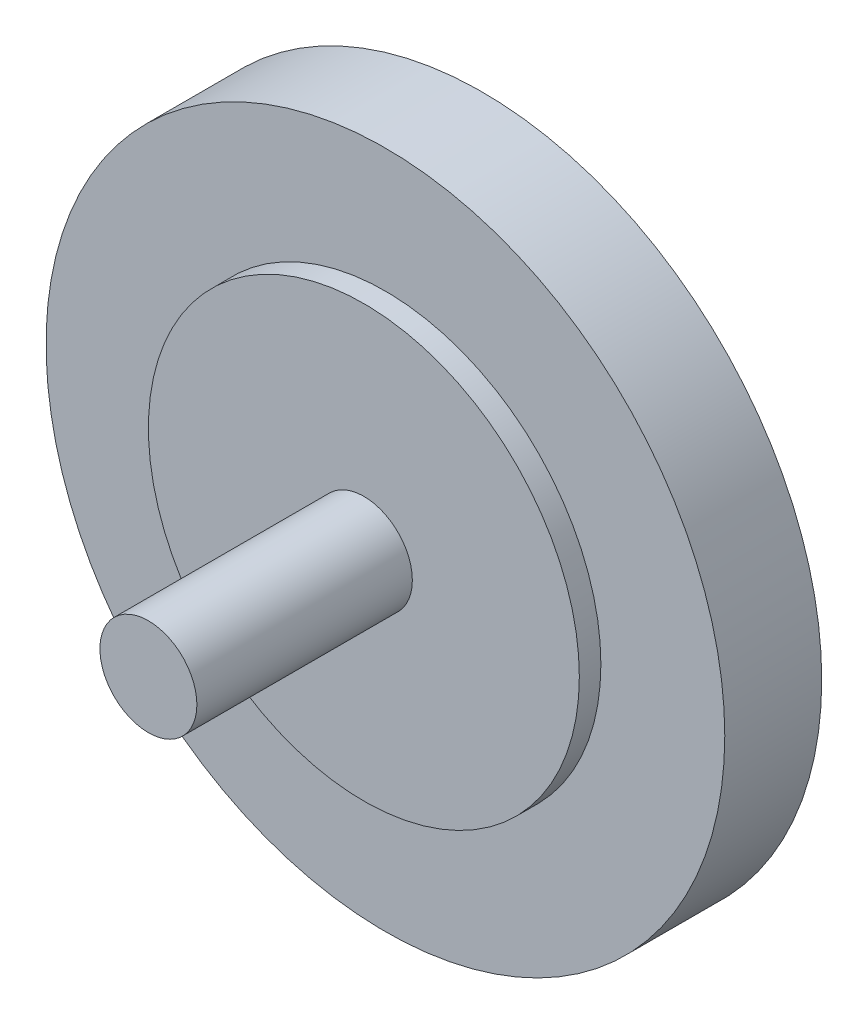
from build123d import *

# Parameters (mm, degrees)
ESQUISSE1_R      = 31.5
EXTRUSION1_DEPTH = 9
ESQUISSE2_R      = 20
EXTRUSION2_DEPTH = 2
ESQUISSE3_R      = 4.5
EXTRUSION3_DEPTH = 20


with BuildPart() as part:
    # Esquisse1 → Extrusion1 (new body)
    with BuildSketch(Plane.XY):
        Circle(ESQUISSE1_R)
    extrude(amount=EXTRUSION1_DEPTH)

    # Esquisse2 → Extrusion2 (add)
    with BuildSketch(Plane.XY.offset(9)):
        Circle(ESQUISSE2_R)
    extrude(amount=EXTRUSION2_DEPTH)

    # Esquisse3 → Extrusion3 (add)
    with BuildSketch(Plane.XY.offset(11)):
        Circle(ESQUISSE3_R)
    extrude(amount=EXTRUSION3_DEPTH)


solid = part.part
